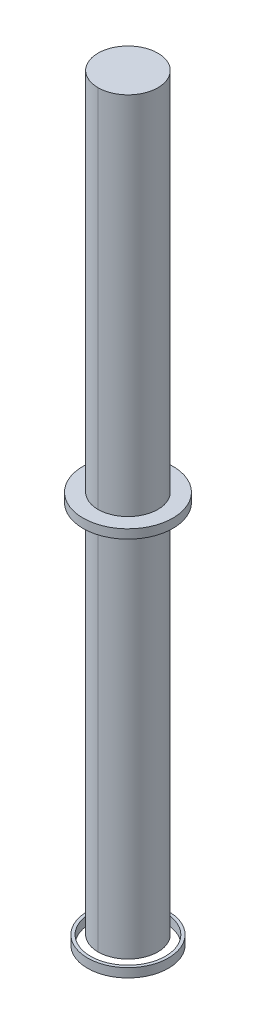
ISO-10303-21;
HEADER;
FILE_DESCRIPTION(('STEP AP214'),'2;1');
FILE_NAME('part.step','',(''),(''),'','','');
FILE_SCHEMA(('AUTOMOTIVE_DESIGN { 1 0 10303 214 1 1 1 1 }'));
ENDSEC;
DATA;
#1=APPLICATION_CONTEXT('core data for automotive mechanical design processes');
#2=APPLICATION_PROTOCOL_DEFINITION('international standard','automotive_design',2000,#1);
#3=PRODUCT_CONTEXT('',#1,'mechanical');
#4=PRODUCT('Part','Part','',(#3));
#5=PRODUCT_RELATED_PRODUCT_CATEGORY('part','',(#4));
#6=PRODUCT_DEFINITION_FORMATION('','',#4);
#7=PRODUCT_DEFINITION_CONTEXT('part definition',#1,'design');
#8=PRODUCT_DEFINITION('design','',#6,#7);
#9=PRODUCT_DEFINITION_SHAPE('','',#8);
#10=(LENGTH_UNIT() NAMED_UNIT(*) SI_UNIT(.MILLI.,.METRE.));
#11=(NAMED_UNIT(*) PLANE_ANGLE_UNIT() SI_UNIT($,.RADIAN.));
#12=(NAMED_UNIT(*) SI_UNIT($,.STERADIAN.) SOLID_ANGLE_UNIT());
#13=UNCERTAINTY_MEASURE_WITH_UNIT(LENGTH_MEASURE(1.E-05),#10,'distance_accuracy_value','');
#14=(GEOMETRIC_REPRESENTATION_CONTEXT(3) GLOBAL_UNCERTAINTY_ASSIGNED_CONTEXT((#13)) GLOBAL_UNIT_ASSIGNED_CONTEXT((#10,
#11,#12)) REPRESENTATION_CONTEXT('',''));
#15=CARTESIAN_POINT('',(0.,0.,0.));
#16=DIRECTION('',(0.,0.,1.));
#17=DIRECTION('',(1.,0.,0.));
#18=AXIS2_PLACEMENT_3D('',#15,#16,#17);
#19=CARTESIAN_POINT('',(0.,-0.6,0.));
#20=DIRECTION('',(0.,1.,0.));
#21=DIRECTION('',(0.,0.,1.));
#22=AXIS2_PLACEMENT_3D('',#19,#20,#21);
#23=CYLINDRICAL_SURFACE('',#22,2.7);
#24=CARTESIAN_POINT('',(0.,-0.6,0.));
#25=DIRECTION('',(0.,1.,0.));
#26=DIRECTION('',(0.,0.,1.));
#27=AXIS2_PLACEMENT_3D('',#24,#25,#26);
#28=CIRCLE('',#27,2.7);
#29=CARTESIAN_POINT('',(0.,-0.6,2.7));
#30=VERTEX_POINT('',#29);
#31=EDGE_CURVE('E11',#30,#30,#28,.T.);
#32=ORIENTED_EDGE('',*,*,#31,.T.);
#33=EDGE_LOOP('',(#32));
#34=FACE_BOUND('',#33,.T.);
#35=CARTESIAN_POINT('',(0.,0.,0.));
#36=DIRECTION('',(0.,1.,0.));
#37=DIRECTION('',(0.,0.,1.));
#38=AXIS2_PLACEMENT_3D('',#35,#36,#37);
#39=CIRCLE('',#38,2.7);
#40=CARTESIAN_POINT('',(0.,0.,2.7));
#41=VERTEX_POINT('',#40);
#42=EDGE_CURVE('E53',#41,#41,#39,.T.);
#43=ORIENTED_EDGE('',*,*,#42,.F.);
#44=EDGE_LOOP('',(#43));
#45=FACE_BOUND('',#44,.T.);
#46=ADVANCED_FACE('F50',(#34,#45),#23,.T.);
#47=CARTESIAN_POINT('',(0.,-0.6,0.));
#48=DIRECTION('',(0.,1.,0.));
#49=DIRECTION('',(0.,0.,1.));
#50=AXIS2_PLACEMENT_3D('',#47,#48,#49);
#51=PLANE('',#50);
#52=CARTESIAN_POINT('',(0.,-0.6,0.));
#53=DIRECTION('',(0.,1.,0.));
#54=DIRECTION('',(0.,0.,1.));
#55=AXIS2_PLACEMENT_3D('',#52,#53,#54);
#56=CIRCLE('',#55,2.5);
#57=CARTESIAN_POINT('',(0.,-0.6,2.5));
#58=VERTEX_POINT('',#57);
#59=EDGE_CURVE('E60',#58,#58,#56,.T.);
#60=ORIENTED_EDGE('',*,*,#59,.T.);
#61=EDGE_LOOP('',(#60));
#62=FACE_BOUND('',#61,.T.);
#63=ORIENTED_EDGE('',*,*,#31,.F.);
#64=EDGE_LOOP('',(#63));
#65=FACE_BOUND('',#64,.T.);
#66=ADVANCED_FACE('F68',(#62,#65),#51,.F.);
#67=CARTESIAN_POINT('',(0.,0.,0.));
#68=DIRECTION('',(0.,1.,0.));
#69=DIRECTION('',(0.,0.,1.));
#70=AXIS2_PLACEMENT_3D('',#67,#68,#69);
#71=PLANE('',#70);
#72=CARTESIAN_POINT('',(0.,0.,0.));
#73=DIRECTION('',(0.,1.,0.));
#74=DIRECTION('',(0.,0.,1.));
#75=AXIS2_PLACEMENT_3D('',#72,#73,#74);
#76=CIRCLE('',#75,2.5);
#77=CARTESIAN_POINT('',(0.,0.,2.5));
#78=VERTEX_POINT('',#77);
#79=EDGE_CURVE('E62',#78,#78,#76,.T.);
#80=ORIENTED_EDGE('',*,*,#79,.F.);
#81=EDGE_LOOP('',(#80));
#82=FACE_BOUND('',#81,.T.);
#83=ORIENTED_EDGE('',*,*,#42,.T.);
#84=EDGE_LOOP('',(#83));
#85=FACE_BOUND('',#84,.T.);
#86=ADVANCED_FACE('F74',(#82,#85),#71,.T.);
#87=CARTESIAN_POINT('',(0.,-0.6,0.));
#88=DIRECTION('',(0.,1.,0.));
#89=DIRECTION('',(0.,0.,1.));
#90=AXIS2_PLACEMENT_3D('',#87,#88,#89);
#91=CYLINDRICAL_SURFACE('',#90,2.5);
#92=ORIENTED_EDGE('',*,*,#59,.F.);
#93=EDGE_LOOP('',(#92));
#94=FACE_BOUND('',#93,.T.);
#95=ORIENTED_EDGE('',*,*,#79,.T.);
#96=EDGE_LOOP('',(#95));
#97=FACE_BOUND('',#96,.T.);
#98=ADVANCED_FACE('F71',(#94,#97),#91,.F.);
#99=CLOSED_SHELL('',(#46,#66,#86,#98));
#100=MANIFOLD_SOLID_BREP('B2_NOT_SHOWN',#99);
#101=CARTESIAN_POINT('',(0.,50.,0.));
#102=DIRECTION('',(0.,-1.,0.));
#103=DIRECTION('',(0.,0.,-1.));
#104=AXIS2_PLACEMENT_3D('',#101,#102,#103);
#105=CYLINDRICAL_SURFACE('',#104,2.);
#106=DIRECTION('',(0.,-1.,0.));
#107=VECTOR('',#106,1.);
#108=CARTESIAN_POINT('',(0.,50.,2.));
#109=LINE('',#108,#107);
#110=CARTESIAN_POINT('',(0.,25.,2.));
#111=VERTEX_POINT('',#110);
#112=CARTESIAN_POINT('',(0.,0.,2.));
#113=VERTEX_POINT('',#112);
#114=EDGE_CURVE('E48',#111,#113,#109,.T.);
#115=ORIENTED_EDGE('',*,*,#114,.F.);
#116=CARTESIAN_POINT('',(0.,25.,0.));
#117=DIRECTION('',(0.,1.,0.));
#118=DIRECTION('',(0.,0.,1.));
#119=AXIS2_PLACEMENT_3D('',#116,#117,#118);
#120=CIRCLE('',#119,2.);
#121=CARTESIAN_POINT('',(0.,25.,-2.));
#122=VERTEX_POINT('',#121);
#123=EDGE_CURVE('E178',#122,#111,#120,.T.);
#124=ORIENTED_EDGE('',*,*,#123,.F.);
#125=DIRECTION('',(0.,-1.,0.));
#126=VECTOR('',#125,1.);
#127=CARTESIAN_POINT('',(0.,50.,-2.));
#128=LINE('',#127,#126);
#129=CARTESIAN_POINT('',(0.,0.,-2.));
#130=VERTEX_POINT('',#129);
#131=EDGE_CURVE('E121',#130,#122,#128,.F.);
#132=ORIENTED_EDGE('',*,*,#131,.F.);
#133=CARTESIAN_POINT('',(0.,0.,0.));
#134=DIRECTION('',(0.,1.,0.));
#135=DIRECTION('',(0.,0.,1.));
#136=AXIS2_PLACEMENT_3D('',#133,#134,#135);
#137=CIRCLE('',#136,2.);
#138=EDGE_CURVE('E175',#130,#113,#137,.T.);
#139=ORIENTED_EDGE('',*,*,#138,.T.);
#140=EDGE_LOOP('',(#115,#124,#132,#139));
#141=FACE_BOUND('',#140,.T.);
#142=ADVANCED_FACE('F111',(#141),#105,.T.);
#143=DIRECTION('',(0.,-1.,0.));
#144=VECTOR('',#143,1.);
#145=CARTESIAN_POINT('',(0.,50.,2.));
#146=LINE('',#145,#144);
#147=CARTESIAN_POINT('',(0.,50.,2.));
#148=VERTEX_POINT('',#147);
#149=CARTESIAN_POINT('',(0.,25.6,2.));
#150=VERTEX_POINT('',#149);
#151=EDGE_CURVE('E153',#148,#150,#146,.T.);
#152=ORIENTED_EDGE('',*,*,#151,.F.);
#153=CARTESIAN_POINT('',(0.,50.,0.));
#154=DIRECTION('',(0.,1.,0.));
#155=DIRECTION('',(0.,0.,1.));
#156=AXIS2_PLACEMENT_3D('',#153,#154,#155);
#157=CIRCLE('',#156,2.);
#158=CARTESIAN_POINT('',(0.,50.,-2.));
#159=VERTEX_POINT('',#158);
#160=EDGE_CURVE('E179',#159,#148,#157,.T.);
#161=ORIENTED_EDGE('',*,*,#160,.F.);
#162=DIRECTION('',(0.,-1.,0.));
#163=VECTOR('',#162,1.);
#164=CARTESIAN_POINT('',(0.,50.,-2.));
#165=LINE('',#164,#163);
#166=CARTESIAN_POINT('',(0.,25.6,-2.));
#167=VERTEX_POINT('',#166);
#168=EDGE_CURVE('E115',#167,#159,#165,.F.);
#169=ORIENTED_EDGE('',*,*,#168,.F.);
#170=CARTESIAN_POINT('',(0.,25.6,0.));
#171=DIRECTION('',(0.,1.,0.));
#172=DIRECTION('',(0.,0.,1.));
#173=AXIS2_PLACEMENT_3D('',#170,#171,#172);
#174=CIRCLE('',#173,2.);
#175=EDGE_CURVE('E164',#167,#150,#174,.T.);
#176=ORIENTED_EDGE('',*,*,#175,.T.);
#177=EDGE_LOOP('',(#152,#161,#169,#176));
#178=FACE_BOUND('',#177,.T.);
#179=ADVANCED_FACE('F165',(#178),#105,.T.);
#180=EDGE_CURVE('E158',#148,#159,#157,.T.);
#181=ORIENTED_EDGE('',*,*,#180,.F.);
#182=ORIENTED_EDGE('',*,*,#151,.T.);
#183=EDGE_CURVE('E156',#150,#167,#174,.T.);
#184=ORIENTED_EDGE('',*,*,#183,.T.);
#185=ORIENTED_EDGE('',*,*,#168,.T.);
#186=EDGE_LOOP('',(#181,#182,#184,#185));
#187=FACE_BOUND('',#186,.T.);
#188=ADVANCED_FACE('F113',(#187),#105,.T.);
#189=CARTESIAN_POINT('',(0.,50.,0.));
#190=DIRECTION('',(0.,1.,0.));
#191=DIRECTION('',(0.,0.,1.));
#192=AXIS2_PLACEMENT_3D('',#189,#190,#191);
#193=PLANE('',#192);
#194=ORIENTED_EDGE('',*,*,#180,.T.);
#195=ORIENTED_EDGE('',*,*,#160,.T.);
#196=EDGE_LOOP('',(#194,#195));
#197=FACE_BOUND('',#196,.T.);
#198=ADVANCED_FACE('F196',(#197),#193,.T.);
#199=CARTESIAN_POINT('',(0.,25.6,0.));
#200=DIRECTION('',(0.,1.,0.));
#201=DIRECTION('',(0.,0.,1.));
#202=AXIS2_PLACEMENT_3D('',#199,#200,#201);
#203=PLANE('',#202);
#204=CARTESIAN_POINT('',(0.,25.6,0.));
#205=DIRECTION('',(0.,1.,0.));
#206=DIRECTION('',(0.,0.,1.));
#207=AXIS2_PLACEMENT_3D('',#204,#205,#206);
#208=CIRCLE('',#207,3.);
#209=CARTESIAN_POINT('',(0.,25.6,3.));
#210=VERTEX_POINT('',#209);
#211=EDGE_CURVE('E171',#210,#210,#208,.T.);
#212=ORIENTED_EDGE('',*,*,#211,.T.);
#213=EDGE_LOOP('',(#212));
#214=FACE_BOUND('',#213,.T.);
#215=ORIENTED_EDGE('',*,*,#183,.F.);
#216=ORIENTED_EDGE('',*,*,#175,.F.);
#217=EDGE_LOOP('',(#215,#216));
#218=FACE_BOUND('',#217,.T.);
#219=ADVANCED_FACE('F168',(#214,#218),#203,.T.);
#220=CARTESIAN_POINT('',(0.,25.,0.));
#221=DIRECTION('',(0.,1.,0.));
#222=DIRECTION('',(0.,0.,1.));
#223=AXIS2_PLACEMENT_3D('',#220,#221,#222);
#224=PLANE('',#223);
#225=CARTESIAN_POINT('',(0.,25.,0.));
#226=DIRECTION('',(0.,1.,0.));
#227=DIRECTION('',(0.,0.,1.));
#228=AXIS2_PLACEMENT_3D('',#225,#226,#227);
#229=CIRCLE('',#228,3.);
#230=CARTESIAN_POINT('',(0.,25.,3.));
#231=VERTEX_POINT('',#230);
#232=EDGE_CURVE('E169',#231,#231,#229,.T.);
#233=ORIENTED_EDGE('',*,*,#232,.F.);
#234=EDGE_LOOP('',(#233));
#235=FACE_BOUND('',#234,.T.);
#236=EDGE_CURVE('E182',#111,#122,#120,.T.);
#237=ORIENTED_EDGE('',*,*,#236,.T.);
#238=ORIENTED_EDGE('',*,*,#123,.T.);
#239=EDGE_LOOP('',(#237,#238));
#240=FACE_BOUND('',#239,.T.);
#241=ADVANCED_FACE('F203',(#235,#240),#224,.F.);
#242=CARTESIAN_POINT('',(0.,25.6,0.));
#243=DIRECTION('',(0.,-1.,0.));
#244=DIRECTION('',(0.,0.,-1.));
#245=AXIS2_PLACEMENT_3D('',#242,#243,#244);
#246=CYLINDRICAL_SURFACE('',#245,3.);
#247=ORIENTED_EDGE('',*,*,#211,.F.);
#248=EDGE_LOOP('',(#247));
#249=FACE_BOUND('',#248,.T.);
#250=ORIENTED_EDGE('',*,*,#232,.T.);
#251=EDGE_LOOP('',(#250));
#252=FACE_BOUND('',#251,.T.);
#253=ADVANCED_FACE('F219',(#249,#252),#246,.T.);
#254=CARTESIAN_POINT('',(0.,0.,0.));
#255=DIRECTION('',(0.,1.,0.));
#256=DIRECTION('',(0.,0.,1.));
#257=AXIS2_PLACEMENT_3D('',#254,#255,#256);
#258=PLANE('',#257);
#259=EDGE_CURVE('E180',#113,#130,#137,.T.);
#260=ORIENTED_EDGE('',*,*,#259,.F.);
#261=ORIENTED_EDGE('',*,*,#138,.F.);
#262=EDGE_LOOP('',(#260,#261));
#263=FACE_BOUND('',#262,.T.);
#264=ADVANCED_FACE('F215',(#263),#258,.F.);
#265=ORIENTED_EDGE('',*,*,#236,.F.);
#266=ORIENTED_EDGE('',*,*,#114,.T.);
#267=ORIENTED_EDGE('',*,*,#259,.T.);
#268=ORIENTED_EDGE('',*,*,#131,.T.);
#269=EDGE_LOOP('',(#265,#266,#267,#268));
#270=FACE_BOUND('',#269,.T.);
#271=ADVANCED_FACE('F206',(#270),#105,.T.);
#272=CLOSED_SHELL('',(#142,#179,#188,#198,#219,#241,#253,#264,#271));
#273=MANIFOLD_SOLID_BREP('B6',#272);
#274=ADVANCED_BREP_SHAPE_REPRESENTATION('',(#18,#100,#273),#14);
#275=SHAPE_DEFINITION_REPRESENTATION(#9,#274);
ENDSEC;
END-ISO-10303-21;
